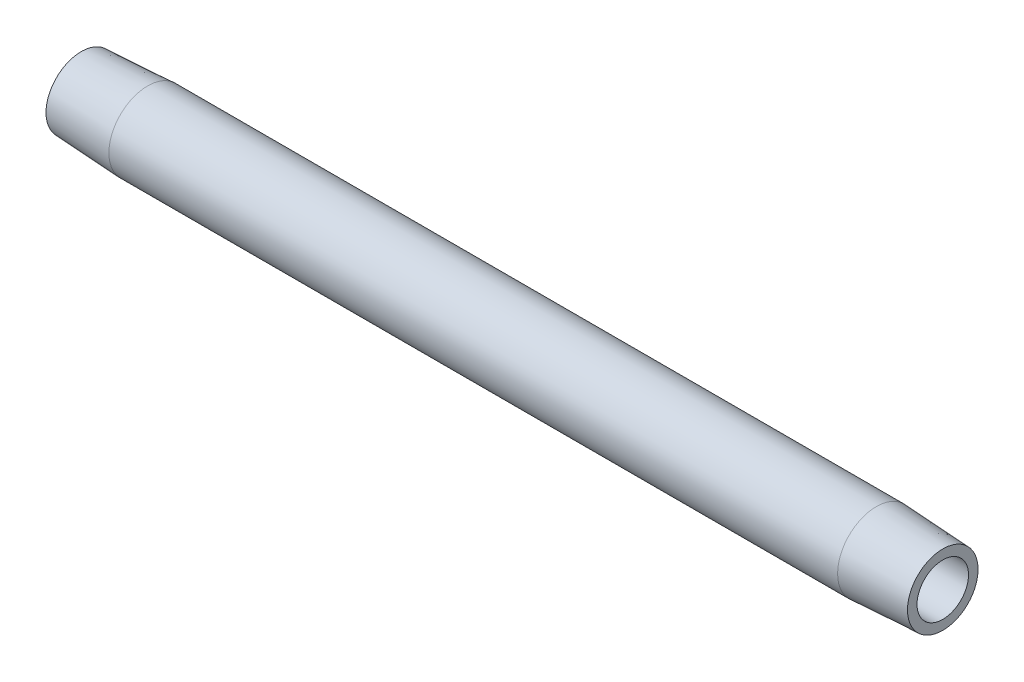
ISO-10303-21;
HEADER;
FILE_DESCRIPTION(('STEP AP214'),'2;1');
FILE_NAME('part.step','',(''),(''),'','','');
FILE_SCHEMA(('AUTOMOTIVE_DESIGN { 1 0 10303 214 1 1 1 1 }'));
ENDSEC;
DATA;
#1=APPLICATION_CONTEXT('core data for automotive mechanical design processes');
#2=APPLICATION_PROTOCOL_DEFINITION('international standard','automotive_design',2000,#1);
#3=PRODUCT_CONTEXT('',#1,'mechanical');
#4=PRODUCT('Part','Part','',(#3));
#5=PRODUCT_RELATED_PRODUCT_CATEGORY('part','',(#4));
#6=PRODUCT_DEFINITION_FORMATION('','',#4);
#7=PRODUCT_DEFINITION_CONTEXT('part definition',#1,'design');
#8=PRODUCT_DEFINITION('design','',#6,#7);
#9=PRODUCT_DEFINITION_SHAPE('','',#8);
#10=(LENGTH_UNIT() NAMED_UNIT(*) SI_UNIT(.MILLI.,.METRE.));
#11=(NAMED_UNIT(*) PLANE_ANGLE_UNIT() SI_UNIT($,.RADIAN.));
#12=(NAMED_UNIT(*) SI_UNIT($,.STERADIAN.) SOLID_ANGLE_UNIT());
#13=UNCERTAINTY_MEASURE_WITH_UNIT(LENGTH_MEASURE(1.E-05),#10,'distance_accuracy_value','');
#14=(GEOMETRIC_REPRESENTATION_CONTEXT(3) GLOBAL_UNCERTAINTY_ASSIGNED_CONTEXT((#13)) GLOBAL_UNIT_ASSIGNED_CONTEXT((#10,
#11,#12)) REPRESENTATION_CONTEXT('',''));
#15=CARTESIAN_POINT('',(0.,0.,0.));
#16=DIRECTION('',(0.,0.,1.));
#17=DIRECTION('',(1.,0.,0.));
#18=AXIS2_PLACEMENT_3D('',#15,#16,#17);
#19=CARTESIAN_POINT('',(0.476141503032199,0.,0.));
#20=DIRECTION('',(-1.,0.,0.));
#21=DIRECTION('',(0.,0.,1.));
#22=AXIS2_PLACEMENT_3D('',#19,#20,#21);
#23=CYLINDRICAL_SURFACE('',#22,5.14349999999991);
#24=CARTESIAN_POINT('',(8.8100393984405,0.,0.));
#25=DIRECTION('',(-1.,0.,0.));
#26=DIRECTION('',(0.,0.,1.));
#27=AXIS2_PLACEMENT_3D('',#24,#25,#26);
#28=CIRCLE('',#27,5.14349999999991);
#29=CARTESIAN_POINT('',(8.8100393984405,0.,5.14349999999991));
#30=VERTEX_POINT('',#29);
#31=EDGE_CURVE('E10',#30,#30,#28,.T.);
#32=ORIENTED_EDGE('',*,*,#31,.F.);
#33=EDGE_LOOP('',(#32));
#34=FACE_BOUND('',#33,.T.);
#35=CARTESIAN_POINT('',(105.489960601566,0.,0.));
#36=DIRECTION('',(-1.,0.,0.));
#37=DIRECTION('',(0.,0.,1.));
#38=AXIS2_PLACEMENT_3D('',#35,#36,#37);
#39=CIRCLE('',#38,5.14349999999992);
#40=CARTESIAN_POINT('',(105.489960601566,0.,5.14349999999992));
#41=VERTEX_POINT('',#40);
#42=EDGE_CURVE('E52',#41,#41,#39,.T.);
#43=ORIENTED_EDGE('',*,*,#42,.T.);
#44=EDGE_LOOP('',(#43));
#45=FACE_BOUND('',#44,.T.);
#46=ADVANCED_FACE('F30',(#34,#45),#23,.T.);
#47=CARTESIAN_POINT('',(8.8100393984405,0.,0.));
#48=DIRECTION('',(1.,0.,0.));
#49=DIRECTION('',(0.,0.,-1.));
#50=AXIS2_PLACEMENT_3D('',#47,#48,#49);
#51=CONICAL_SURFACE('',#50,5.14349999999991,0.0523598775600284);
#52=CARTESIAN_POINT('',(0.,0.,0.));
#53=DIRECTION('',(-1.,0.,0.));
#54=DIRECTION('',(0.,0.,1.));
#55=AXIS2_PLACEMENT_3D('',#52,#53,#54);
#56=CIRCLE('',#55,4.68178539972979);
#57=CARTESIAN_POINT('',(0.,0.,4.68178539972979));
#58=VERTEX_POINT('',#57);
#59=EDGE_CURVE('E36',#58,#58,#56,.T.);
#60=ORIENTED_EDGE('',*,*,#59,.F.);
#61=EDGE_LOOP('',(#60));
#62=FACE_BOUND('',#61,.T.);
#63=ORIENTED_EDGE('',*,*,#31,.T.);
#64=EDGE_LOOP('',(#63));
#65=FACE_BOUND('',#64,.T.);
#66=ADVANCED_FACE('F77',(#62,#65),#51,.T.);
#67=CARTESIAN_POINT('',(0.,4.68178539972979,0.));
#68=DIRECTION('',(1.,0.,0.));
#69=DIRECTION('',(0.,0.,-1.));
#70=AXIS2_PLACEMENT_3D('',#67,#68,#69);
#71=PLANE('',#70);
#72=CARTESIAN_POINT('',(0.,0.,0.));
#73=DIRECTION('',(-1.,0.,0.));
#74=DIRECTION('',(0.,0.,1.));
#75=AXIS2_PLACEMENT_3D('',#72,#73,#74);
#76=CIRCLE('',#75,3.4163);
#77=CARTESIAN_POINT('',(0.,0.,3.4163));
#78=VERTEX_POINT('',#77);
#79=EDGE_CURVE('E40',#78,#78,#76,.T.);
#80=ORIENTED_EDGE('',*,*,#79,.F.);
#81=EDGE_LOOP('',(#80));
#82=FACE_BOUND('',#81,.T.);
#83=ORIENTED_EDGE('',*,*,#59,.T.);
#84=EDGE_LOOP('',(#83));
#85=FACE_BOUND('',#84,.T.);
#86=ADVANCED_FACE('F72',(#82,#85),#71,.F.);
#87=CARTESIAN_POINT('',(0.476141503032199,0.,0.));
#88=DIRECTION('',(-1.,0.,0.));
#89=DIRECTION('',(0.,0.,1.));
#90=AXIS2_PLACEMENT_3D('',#87,#88,#89);
#91=CYLINDRICAL_SURFACE('',#90,3.4163);
#92=CARTESIAN_POINT('',(114.3,0.,0.));
#93=DIRECTION('',(-1.,0.,0.));
#94=DIRECTION('',(0.,0.,1.));
#95=AXIS2_PLACEMENT_3D('',#92,#93,#94);
#96=CIRCLE('',#95,3.4163);
#97=CARTESIAN_POINT('',(114.3,0.,3.4163));
#98=VERTEX_POINT('',#97);
#99=EDGE_CURVE('E44',#98,#98,#96,.T.);
#100=ORIENTED_EDGE('',*,*,#99,.F.);
#101=EDGE_LOOP('',(#100));
#102=FACE_BOUND('',#101,.T.);
#103=ORIENTED_EDGE('',*,*,#79,.T.);
#104=EDGE_LOOP('',(#103));
#105=FACE_BOUND('',#104,.T.);
#106=ADVANCED_FACE('F66',(#102,#105),#91,.F.);
#107=CARTESIAN_POINT('',(114.3,3.4163,0.));
#108=DIRECTION('',(-1.,0.,0.));
#109=DIRECTION('',(0.,0.,1.));
#110=AXIS2_PLACEMENT_3D('',#107,#108,#109);
#111=PLANE('',#110);
#112=CARTESIAN_POINT('',(114.3,0.,0.));
#113=DIRECTION('',(-1.,0.,0.));
#114=DIRECTION('',(0.,0.,1.));
#115=AXIS2_PLACEMENT_3D('',#112,#113,#114);
#116=CIRCLE('',#115,4.68178539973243);
#117=CARTESIAN_POINT('',(114.3,0.,4.68178539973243));
#118=VERTEX_POINT('',#117);
#119=EDGE_CURVE('E49',#118,#118,#116,.T.);
#120=ORIENTED_EDGE('',*,*,#119,.F.);
#121=EDGE_LOOP('',(#120));
#122=FACE_BOUND('',#121,.T.);
#123=ORIENTED_EDGE('',*,*,#99,.T.);
#124=EDGE_LOOP('',(#123));
#125=FACE_BOUND('',#124,.T.);
#126=ADVANCED_FACE('F60',(#122,#125),#111,.F.);
#127=CARTESIAN_POINT('',(114.3,0.,0.));
#128=DIRECTION('',(-1.,0.,0.));
#129=DIRECTION('',(0.,0.,1.));
#130=AXIS2_PLACEMENT_3D('',#127,#128,#129);
#131=CONICAL_SURFACE('',#130,4.68178539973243,0.0523598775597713);
#132=ORIENTED_EDGE('',*,*,#42,.F.);
#133=EDGE_LOOP('',(#132));
#134=FACE_BOUND('',#133,.T.);
#135=ORIENTED_EDGE('',*,*,#119,.T.);
#136=EDGE_LOOP('',(#135));
#137=FACE_BOUND('',#136,.T.);
#138=ADVANCED_FACE('F57',(#134,#137),#131,.T.);
#139=CLOSED_SHELL('',(#46,#66,#86,#106,#126,#138));
#140=MANIFOLD_SOLID_BREP('B2',#139);
#141=ADVANCED_BREP_SHAPE_REPRESENTATION('',(#18,#140),#14);
#142=SHAPE_DEFINITION_REPRESENTATION(#9,#141);
ENDSEC;
END-ISO-10303-21;
